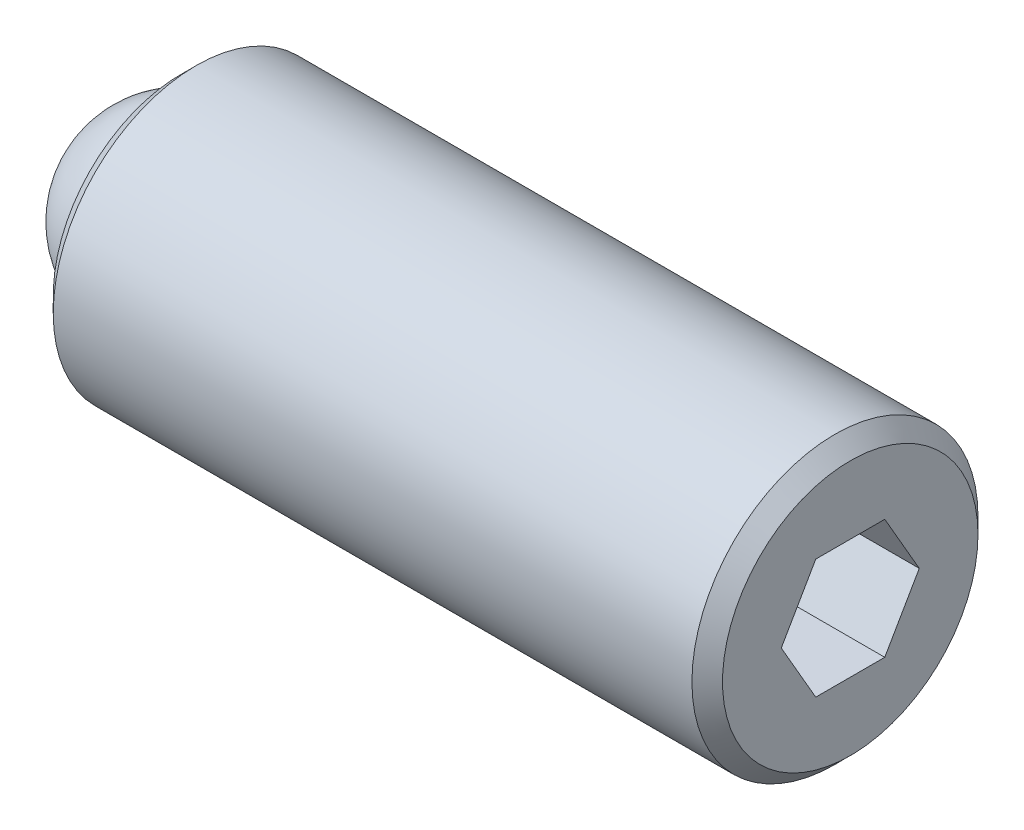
ISO-10303-21;
HEADER;
FILE_DESCRIPTION(('STEP AP214'),'2;1');
FILE_NAME('part.step','',(''),(''),'','','');
FILE_SCHEMA(('AUTOMOTIVE_DESIGN { 1 0 10303 214 1 1 1 1 }'));
ENDSEC;
DATA;
#1=APPLICATION_CONTEXT('core data for automotive mechanical design processes');
#2=APPLICATION_PROTOCOL_DEFINITION('international standard','automotive_design',2000,#1);
#3=PRODUCT_CONTEXT('',#1,'mechanical');
#4=PRODUCT('Part','Part','',(#3));
#5=PRODUCT_RELATED_PRODUCT_CATEGORY('part','',(#4));
#6=PRODUCT_DEFINITION_FORMATION('','',#4);
#7=PRODUCT_DEFINITION_CONTEXT('part definition',#1,'design');
#8=PRODUCT_DEFINITION('design','',#6,#7);
#9=PRODUCT_DEFINITION_SHAPE('','',#8);
#10=(LENGTH_UNIT() NAMED_UNIT(*) SI_UNIT(.MILLI.,.METRE.));
#11=(NAMED_UNIT(*) PLANE_ANGLE_UNIT() SI_UNIT($,.RADIAN.));
#12=(NAMED_UNIT(*) SI_UNIT($,.STERADIAN.) SOLID_ANGLE_UNIT());
#13=UNCERTAINTY_MEASURE_WITH_UNIT(LENGTH_MEASURE(1.E-05),#10,'distance_accuracy_value','');
#14=(GEOMETRIC_REPRESENTATION_CONTEXT(3) GLOBAL_UNCERTAINTY_ASSIGNED_CONTEXT((#13)) GLOBAL_UNIT_ASSIGNED_CONTEXT((#10,
#11,#12)) REPRESENTATION_CONTEXT('',''));
#15=CARTESIAN_POINT('',(0.,0.,0.));
#16=DIRECTION('',(0.,0.,1.));
#17=DIRECTION('',(1.,0.,0.));
#18=AXIS2_PLACEMENT_3D('',#15,#16,#17);
#19=CARTESIAN_POINT('',(0.,0.,0.));
#20=DIRECTION('',(0.,-1.,0.));
#21=DIRECTION('',(0.,0.,1.));
#22=AXIS2_PLACEMENT_3D('',#19,#20,#21);
#23=SPHERICAL_SURFACE('',#22,1.5875);
#24=CARTESIAN_POINT('',(0.,-1.5875,0.));
#25=VERTEX_POINT('',#24);
#26=VERTEX_LOOP('',#25);
#27=FACE_BOUND('',#26,.T.);
#28=ADVANCED_FACE('F43',(#27),#23,.T.);
#29=CLOSED_SHELL('',(#28));
#30=MANIFOLD_SOLID_BREP('B2',#29);
#31=CARTESIAN_POINT('',(11.1125,0.,0.));
#32=DIRECTION('',(-1.,0.,0.));
#33=DIRECTION('',(0.,0.,1.));
#34=AXIS2_PLACEMENT_3D('',#31,#32,#33);
#35=CYLINDRICAL_SURFACE('',#34,2.3749);
#36=CARTESIAN_POINT('',(10.8585,0.,0.));
#37=DIRECTION('',(1.,0.,0.));
#38=DIRECTION('',(0.,0.,-1.));
#39=AXIS2_PLACEMENT_3D('',#36,#37,#38);
#40=CIRCLE('',#39,2.3749);
#41=CARTESIAN_POINT('',(10.8585,0.,-2.3749));
#42=VERTEX_POINT('',#41);
#43=EDGE_CURVE('E41',#42,#42,#40,.F.);
#44=ORIENTED_EDGE('',*,*,#43,.T.);
#45=EDGE_LOOP('',(#44));
#46=FACE_BOUND('',#45,.T.);
#47=CARTESIAN_POINT('',(0.254000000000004,0.,0.));
#48=DIRECTION('',(1.,0.,0.));
#49=DIRECTION('',(0.,0.,-1.));
#50=AXIS2_PLACEMENT_3D('',#47,#48,#49);
#51=CIRCLE('',#50,2.3749);
#52=CARTESIAN_POINT('',(0.254000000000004,0.,-2.3749));
#53=VERTEX_POINT('',#52);
#54=EDGE_CURVE('E177',#53,#53,#51,.T.);
#55=ORIENTED_EDGE('',*,*,#54,.T.);
#56=EDGE_LOOP('',(#55));
#57=FACE_BOUND('',#56,.T.);
#58=ADVANCED_FACE('F56',(#46,#57),#35,.T.);
#59=CARTESIAN_POINT('',(11.1125,0.,0.));
#60=DIRECTION('',(1.,0.,0.));
#61=DIRECTION('',(0.,0.,-1.));
#62=AXIS2_PLACEMENT_3D('',#59,#60,#61);
#63=PLANE('',#62);
#64=DIRECTION('',(0.,0.866025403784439,-0.5));
#65=VECTOR('',#64,1.);
#66=CARTESIAN_POINT('',(11.1125,-0.992187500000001,-0.572839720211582));
#67=LINE('',#66,#65);
#68=CARTESIAN_POINT('',(11.1125,-0.992187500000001,-0.572839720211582));
#69=VERTEX_POINT('',#68);
#70=CARTESIAN_POINT('',(11.1125,0.,-1.14567944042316));
#71=VERTEX_POINT('',#70);
#72=EDGE_CURVE('E78',#69,#71,#67,.T.);
#73=ORIENTED_EDGE('',*,*,#72,.F.);
#74=DIRECTION('',(0.,0.,-1.));
#75=VECTOR('',#74,1.);
#76=CARTESIAN_POINT('',(11.1125,-0.992187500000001,0.572839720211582));
#77=LINE('',#76,#75);
#78=CARTESIAN_POINT('',(11.1125,-0.992187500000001,0.572839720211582));
#79=VERTEX_POINT('',#78);
#80=EDGE_CURVE('E146',#79,#69,#77,.T.);
#81=ORIENTED_EDGE('',*,*,#80,.F.);
#82=DIRECTION('',(0.,-0.866025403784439,-0.5));
#83=VECTOR('',#82,1.);
#84=CARTESIAN_POINT('',(11.1125,0.,1.14567944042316));
#85=LINE('',#84,#83);
#86=CARTESIAN_POINT('',(11.1125,0.,1.14567944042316));
#87=VERTEX_POINT('',#86);
#88=EDGE_CURVE('E170',#87,#79,#85,.T.);
#89=ORIENTED_EDGE('',*,*,#88,.F.);
#90=DIRECTION('',(0.,-0.866025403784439,0.5));
#91=VECTOR('',#90,1.);
#92=CARTESIAN_POINT('',(11.1125,0.992187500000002,0.572839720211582));
#93=LINE('',#92,#91);
#94=CARTESIAN_POINT('',(11.1125,0.992187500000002,0.572839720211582));
#95=VERTEX_POINT('',#94);
#96=EDGE_CURVE('E167',#95,#87,#93,.T.);
#97=ORIENTED_EDGE('',*,*,#96,.F.);
#98=DIRECTION('',(0.,0.,1.));
#99=VECTOR('',#98,1.);
#100=CARTESIAN_POINT('',(11.1125,0.992187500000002,-0.572839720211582));
#101=LINE('',#100,#99);
#102=CARTESIAN_POINT('',(11.1125,0.992187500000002,-0.572839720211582));
#103=VERTEX_POINT('',#102);
#104=EDGE_CURVE('E164',#103,#95,#101,.T.);
#105=ORIENTED_EDGE('',*,*,#104,.F.);
#106=DIRECTION('',(0.,0.866025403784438,0.5));
#107=VECTOR('',#106,1.);
#108=CARTESIAN_POINT('',(11.1125,0.,-1.14567944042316));
#109=LINE('',#108,#107);
#110=EDGE_CURVE('E137',#71,#103,#109,.T.);
#111=ORIENTED_EDGE('',*,*,#110,.F.);
#112=EDGE_LOOP('',(#73,#81,#89,#97,#105,#111));
#113=FACE_BOUND('',#112,.T.);
#114=CARTESIAN_POINT('',(11.1125,0.,0.));
#115=DIRECTION('',(1.,0.,0.));
#116=DIRECTION('',(0.,0.,-1.));
#117=AXIS2_PLACEMENT_3D('',#114,#115,#116);
#118=CIRCLE('',#117,2.1209);
#119=CARTESIAN_POINT('',(11.1125,0.,-2.1209));
#120=VERTEX_POINT('',#119);
#121=EDGE_CURVE('E64',#120,#120,#118,.T.);
#122=ORIENTED_EDGE('',*,*,#121,.T.);
#123=EDGE_LOOP('',(#122));
#124=FACE_BOUND('',#123,.T.);
#125=ADVANCED_FACE('F194',(#113,#124),#63,.T.);
#126=CARTESIAN_POINT('',(0.,0.,0.));
#127=DIRECTION('',(1.,0.,0.));
#128=DIRECTION('',(0.,0.,-1.));
#129=AXIS2_PLACEMENT_3D('',#126,#127,#128);
#130=PLANE('',#129);
#131=CARTESIAN_POINT('',(0.,0.,0.));
#132=DIRECTION('',(-1.,0.,0.));
#133=DIRECTION('',(0.,0.,1.));
#134=AXIS2_PLACEMENT_3D('',#131,#132,#133);
#135=CIRCLE('',#134,1.5875);
#136=CARTESIAN_POINT('',(0.,1.58623,-0.0634872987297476));
#137=VERTEX_POINT('',#136);
#138=CARTESIAN_POINT('',(0.,1.58623,0.0634872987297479));
#139=VERTEX_POINT('',#138);
#140=EDGE_CURVE('E133',#137,#139,#135,.T.);
#141=ORIENTED_EDGE('',*,*,#140,.F.);
#142=CARTESIAN_POINT('',(0.,1.5875,0.));
#143=DIRECTION('',(-1.,0.,0.));
#144=DIRECTION('',(0.,0.,1.));
#145=AXIS2_PLACEMENT_3D('',#142,#143,#144);
#146=CIRCLE('',#145,0.0635000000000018);
#147=EDGE_CURVE('E126',#139,#137,#146,.T.);
#148=ORIENTED_EDGE('',*,*,#147,.F.);
#149=EDGE_LOOP('',(#141,#148));
#150=FACE_BOUND('',#149,.T.);
#151=CARTESIAN_POINT('',(0.,0.,0.));
#152=DIRECTION('',(1.,0.,0.));
#153=DIRECTION('',(0.,0.,-1.));
#154=AXIS2_PLACEMENT_3D('',#151,#152,#153);
#155=CIRCLE('',#154,2.12089999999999);
#156=CARTESIAN_POINT('',(0.,0.,-2.12089999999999));
#157=VERTEX_POINT('',#156);
#158=EDGE_CURVE('E189',#157,#157,#155,.F.);
#159=ORIENTED_EDGE('',*,*,#158,.T.);
#160=EDGE_LOOP('',(#159));
#161=FACE_BOUND('',#160,.T.);
#162=ADVANCED_FACE('F206',(#150,#161),#130,.F.);
#163=CARTESIAN_POINT('',(0.254000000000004,0.,0.));
#164=DIRECTION('',(1.,0.,0.));
#165=DIRECTION('',(0.,0.,-1.));
#166=AXIS2_PLACEMENT_3D('',#163,#164,#165);
#167=CONICAL_SURFACE('',#166,2.3749,0.78539816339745);
#168=ORIENTED_EDGE('',*,*,#158,.F.);
#169=EDGE_LOOP('',(#168));
#170=FACE_BOUND('',#169,.T.);
#171=ORIENTED_EDGE('',*,*,#54,.F.);
#172=EDGE_LOOP('',(#171));
#173=FACE_BOUND('',#172,.T.);
#174=ADVANCED_FACE('F198',(#170,#173),#167,.T.);
#175=CARTESIAN_POINT('',(11.1125,0.,0.));
#176=DIRECTION('',(-1.,0.,0.));
#177=DIRECTION('',(0.,0.,1.));
#178=AXIS2_PLACEMENT_3D('',#175,#176,#177);
#179=CONICAL_SURFACE('',#178,2.1209,0.785398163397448);
#180=ORIENTED_EDGE('',*,*,#43,.F.);
#181=EDGE_LOOP('',(#180));
#182=FACE_BOUND('',#181,.T.);
#183=ORIENTED_EDGE('',*,*,#121,.F.);
#184=EDGE_LOOP('',(#183));
#185=FACE_BOUND('',#184,.T.);
#186=ADVANCED_FACE('F58',(#182,#185),#179,.T.);
#187=CARTESIAN_POINT('',(8.8265,-0.992187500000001,-0.572839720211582));
#188=DIRECTION('',(0.,-0.5,-0.866025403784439));
#189=DIRECTION('',(0.,0.866025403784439,-0.5));
#190=AXIS2_PLACEMENT_3D('',#187,#188,#189);
#191=PLANE('',#190);
#192=ORIENTED_EDGE('',*,*,#72,.T.);
#193=DIRECTION('',(1.,0.,0.));
#194=VECTOR('',#193,1.);
#195=CARTESIAN_POINT('',(8.8265,0.,-1.14567944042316));
#196=LINE('',#195,#194);
#197=CARTESIAN_POINT('',(8.8265,0.,-1.14567944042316));
#198=VERTEX_POINT('',#197);
#199=EDGE_CURVE('E160',#198,#71,#196,.T.);
#200=ORIENTED_EDGE('',*,*,#199,.F.);
#201=DIRECTION('',(0.,0.866025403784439,-0.5));
#202=VECTOR('',#201,1.);
#203=CARTESIAN_POINT('',(8.8265,-0.992187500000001,-0.572839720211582));
#204=LINE('',#203,#202);
#205=CARTESIAN_POINT('',(8.8265,-0.992187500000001,-0.572839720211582));
#206=VERTEX_POINT('',#205);
#207=EDGE_CURVE('E142',#206,#198,#204,.T.);
#208=ORIENTED_EDGE('',*,*,#207,.F.);
#209=DIRECTION('',(1.,0.,0.));
#210=VECTOR('',#209,1.);
#211=CARTESIAN_POINT('',(8.8265,-0.992187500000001,-0.572839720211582));
#212=LINE('',#211,#210);
#213=EDGE_CURVE('E175',#206,#69,#212,.T.);
#214=ORIENTED_EDGE('',*,*,#213,.T.);
#215=EDGE_LOOP('',(#192,#200,#208,#214));
#216=FACE_BOUND('',#215,.T.);
#217=ADVANCED_FACE('F197',(#216),#191,.F.);
#218=CARTESIAN_POINT('',(8.8265,-0.992187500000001,0.572839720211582));
#219=DIRECTION('',(0.,-1.,0.));
#220=DIRECTION('',(0.,0.,-1.));
#221=AXIS2_PLACEMENT_3D('',#218,#219,#220);
#222=PLANE('',#221);
#223=ORIENTED_EDGE('',*,*,#80,.T.);
#224=ORIENTED_EDGE('',*,*,#213,.F.);
#225=DIRECTION('',(0.,0.,-1.));
#226=VECTOR('',#225,1.);
#227=CARTESIAN_POINT('',(8.8265,-0.992187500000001,0.572839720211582));
#228=LINE('',#227,#226);
#229=CARTESIAN_POINT('',(8.8265,-0.992187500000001,0.572839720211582));
#230=VERTEX_POINT('',#229);
#231=EDGE_CURVE('E158',#230,#206,#228,.T.);
#232=ORIENTED_EDGE('',*,*,#231,.F.);
#233=DIRECTION('',(1.,0.,0.));
#234=VECTOR('',#233,1.);
#235=CARTESIAN_POINT('',(8.8265,-0.992187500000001,0.572839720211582));
#236=LINE('',#235,#234);
#237=EDGE_CURVE('E178',#230,#79,#236,.T.);
#238=ORIENTED_EDGE('',*,*,#237,.T.);
#239=EDGE_LOOP('',(#223,#224,#232,#238));
#240=FACE_BOUND('',#239,.T.);
#241=ADVANCED_FACE('F204',(#240),#222,.F.);
#242=CARTESIAN_POINT('',(8.8265,0.,1.14567944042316));
#243=DIRECTION('',(0.,-0.5,0.866025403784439));
#244=DIRECTION('',(0.,-0.866025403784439,-0.5));
#245=AXIS2_PLACEMENT_3D('',#242,#243,#244);
#246=PLANE('',#245);
#247=ORIENTED_EDGE('',*,*,#88,.T.);
#248=ORIENTED_EDGE('',*,*,#237,.F.);
#249=DIRECTION('',(0.,-0.866025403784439,-0.5));
#250=VECTOR('',#249,1.);
#251=CARTESIAN_POINT('',(8.8265,0.,1.14567944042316));
#252=LINE('',#251,#250);
#253=CARTESIAN_POINT('',(8.8265,0.,1.14567944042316));
#254=VERTEX_POINT('',#253);
#255=EDGE_CURVE('E155',#254,#230,#252,.T.);
#256=ORIENTED_EDGE('',*,*,#255,.F.);
#257=DIRECTION('',(1.,0.,0.));
#258=VECTOR('',#257,1.);
#259=CARTESIAN_POINT('',(8.8265,0.,1.14567944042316));
#260=LINE('',#259,#258);
#261=EDGE_CURVE('E180',#254,#87,#260,.T.);
#262=ORIENTED_EDGE('',*,*,#261,.T.);
#263=EDGE_LOOP('',(#247,#248,#256,#262));
#264=FACE_BOUND('',#263,.T.);
#265=ADVANCED_FACE('F234',(#264),#246,.F.);
#266=CARTESIAN_POINT('',(8.8265,0.992187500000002,0.572839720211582));
#267=DIRECTION('',(0.,0.5,0.866025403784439));
#268=DIRECTION('',(0.,-0.866025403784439,0.5));
#269=AXIS2_PLACEMENT_3D('',#266,#267,#268);
#270=PLANE('',#269);
#271=ORIENTED_EDGE('',*,*,#96,.T.);
#272=ORIENTED_EDGE('',*,*,#261,.F.);
#273=DIRECTION('',(0.,-0.866025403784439,0.5));
#274=VECTOR('',#273,1.);
#275=CARTESIAN_POINT('',(8.8265,0.992187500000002,0.572839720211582));
#276=LINE('',#275,#274);
#277=CARTESIAN_POINT('',(8.8265,0.992187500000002,0.572839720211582));
#278=VERTEX_POINT('',#277);
#279=EDGE_CURVE('E152',#278,#254,#276,.T.);
#280=ORIENTED_EDGE('',*,*,#279,.F.);
#281=DIRECTION('',(1.,0.,0.));
#282=VECTOR('',#281,1.);
#283=CARTESIAN_POINT('',(8.8265,0.992187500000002,0.572839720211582));
#284=LINE('',#283,#282);
#285=EDGE_CURVE('E182',#278,#95,#284,.T.);
#286=ORIENTED_EDGE('',*,*,#285,.T.);
#287=EDGE_LOOP('',(#271,#272,#280,#286));
#288=FACE_BOUND('',#287,.T.);
#289=ADVANCED_FACE('F230',(#288),#270,.F.);
#290=CARTESIAN_POINT('',(8.8265,0.992187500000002,-0.572839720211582));
#291=DIRECTION('',(0.,1.,0.));
#292=DIRECTION('',(0.,0.,1.));
#293=AXIS2_PLACEMENT_3D('',#290,#291,#292);
#294=PLANE('',#293);
#295=ORIENTED_EDGE('',*,*,#104,.T.);
#296=ORIENTED_EDGE('',*,*,#285,.F.);
#297=DIRECTION('',(0.,0.,1.));
#298=VECTOR('',#297,1.);
#299=CARTESIAN_POINT('',(8.8265,0.992187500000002,-0.572839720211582));
#300=LINE('',#299,#298);
#301=CARTESIAN_POINT('',(8.8265,0.992187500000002,-0.572839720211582));
#302=VERTEX_POINT('',#301);
#303=EDGE_CURVE('E149',#302,#278,#300,.T.);
#304=ORIENTED_EDGE('',*,*,#303,.F.);
#305=DIRECTION('',(1.,0.,0.));
#306=VECTOR('',#305,1.);
#307=CARTESIAN_POINT('',(8.8265,0.992187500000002,-0.572839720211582));
#308=LINE('',#307,#306);
#309=EDGE_CURVE('E184',#302,#103,#308,.T.);
#310=ORIENTED_EDGE('',*,*,#309,.T.);
#311=EDGE_LOOP('',(#295,#296,#304,#310));
#312=FACE_BOUND('',#311,.T.);
#313=ADVANCED_FACE('F226',(#312),#294,.F.);
#314=CARTESIAN_POINT('',(8.8265,0.,-1.14567944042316));
#315=DIRECTION('',(0.,0.5,-0.866025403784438));
#316=DIRECTION('',(0.,0.866025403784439,0.5));
#317=AXIS2_PLACEMENT_3D('',#314,#315,#316);
#318=PLANE('',#317);
#319=ORIENTED_EDGE('',*,*,#110,.T.);
#320=ORIENTED_EDGE('',*,*,#309,.F.);
#321=DIRECTION('',(0.,0.866025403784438,0.5));
#322=VECTOR('',#321,1.);
#323=CARTESIAN_POINT('',(8.8265,0.,-1.14567944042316));
#324=LINE('',#323,#322);
#325=EDGE_CURVE('E145',#198,#302,#324,.T.);
#326=ORIENTED_EDGE('',*,*,#325,.F.);
#327=ORIENTED_EDGE('',*,*,#199,.T.);
#328=EDGE_LOOP('',(#319,#320,#326,#327));
#329=FACE_BOUND('',#328,.T.);
#330=ADVANCED_FACE('F222',(#329),#318,.F.);
#331=CARTESIAN_POINT('',(8.8265,0.,0.));
#332=DIRECTION('',(1.,0.,0.));
#333=DIRECTION('',(0.,0.,-1.));
#334=AXIS2_PLACEMENT_3D('',#331,#332,#333);
#335=PLANE('',#334);
#336=ORIENTED_EDGE('',*,*,#207,.T.);
#337=ORIENTED_EDGE('',*,*,#325,.T.);
#338=ORIENTED_EDGE('',*,*,#303,.T.);
#339=ORIENTED_EDGE('',*,*,#279,.T.);
#340=ORIENTED_EDGE('',*,*,#255,.T.);
#341=ORIENTED_EDGE('',*,*,#231,.T.);
#342=EDGE_LOOP('',(#336,#337,#338,#339,#340,#341));
#343=FACE_BOUND('',#342,.T.);
#344=ADVANCED_FACE('F225',(#343),#335,.T.);
#345=CARTESIAN_POINT('',(1.5875,0.,0.));
#346=DIRECTION('',(-1.,0.,0.));
#347=DIRECTION('',(0.,0.,1.));
#348=AXIS2_PLACEMENT_3D('',#345,#346,#347);
#349=CYLINDRICAL_SURFACE('',#348,1.5875);
#350=CARTESIAN_POINT('',(1.5875,0.,0.));
#351=DIRECTION('',(-1.,0.,0.));
#352=DIRECTION('',(0.,0.,1.));
#353=AXIS2_PLACEMENT_3D('',#350,#351,#352);
#354=CIRCLE('',#353,1.5875);
#355=CARTESIAN_POINT('',(1.5875,1.58623,-0.0634872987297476));
#356=VERTEX_POINT('',#355);
#357=CARTESIAN_POINT('',(1.5875,1.58623,0.0634872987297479));
#358=VERTEX_POINT('',#357);
#359=EDGE_CURVE('E131',#356,#358,#354,.T.);
#360=ORIENTED_EDGE('',*,*,#359,.F.);
#361=DIRECTION('',(-1.,0.,0.));
#362=VECTOR('',#361,1.);
#363=CARTESIAN_POINT('',(1.5875,1.58623,-0.0634872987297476));
#364=LINE('',#363,#362);
#365=EDGE_CURVE('E124',#356,#137,#364,.T.);
#366=ORIENTED_EDGE('',*,*,#365,.T.);
#367=ORIENTED_EDGE('',*,*,#140,.T.);
#368=DIRECTION('',(-1.,0.,0.));
#369=VECTOR('',#368,1.);
#370=CARTESIAN_POINT('',(1.5875,1.58623,0.0634872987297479));
#371=LINE('',#370,#369);
#372=EDGE_CURVE('E121',#358,#139,#371,.T.);
#373=ORIENTED_EDGE('',*,*,#372,.F.);
#374=EDGE_LOOP('',(#360,#366,#367,#373));
#375=FACE_BOUND('',#374,.T.);
#376=ADVANCED_FACE('F130',(#375),#349,.F.);
#377=CARTESIAN_POINT('',(1.5875,0.,0.));
#378=DIRECTION('',(-1.,0.,0.));
#379=DIRECTION('',(0.,0.,1.));
#380=AXIS2_PLACEMENT_3D('',#377,#378,#379);
#381=PLANE('',#380);
#382=ORIENTED_EDGE('',*,*,#359,.T.);
#383=CARTESIAN_POINT('',(1.5875,1.5875,0.));
#384=DIRECTION('',(-1.,0.,0.));
#385=DIRECTION('',(0.,0.,1.));
#386=AXIS2_PLACEMENT_3D('',#383,#384,#385);
#387=CIRCLE('',#386,0.0635000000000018);
#388=EDGE_CURVE('E70',#358,#356,#387,.T.);
#389=ORIENTED_EDGE('',*,*,#388,.T.);
#390=EDGE_LOOP('',(#382,#389));
#391=FACE_BOUND('',#390,.T.);
#392=ADVANCED_FACE('F135',(#391),#381,.T.);
#393=CARTESIAN_POINT('',(1.5875,1.5875,0.));
#394=DIRECTION('',(-1.,0.,0.));
#395=DIRECTION('',(0.,0.,1.));
#396=AXIS2_PLACEMENT_3D('',#393,#394,#395);
#397=CYLINDRICAL_SURFACE('',#396,0.0635000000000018);
#398=ORIENTED_EDGE('',*,*,#147,.T.);
#399=ORIENTED_EDGE('',*,*,#365,.F.);
#400=ORIENTED_EDGE('',*,*,#388,.F.);
#401=ORIENTED_EDGE('',*,*,#372,.T.);
#402=EDGE_LOOP('',(#398,#399,#400,#401));
#403=FACE_BOUND('',#402,.T.);
#404=ADVANCED_FACE('F120',(#403),#397,.F.);
#405=CLOSED_SHELL('',(#58,#125,#162,#174,#186,#217,#241,#265,#289,#313,#330,#344,#376,#392,#404));
#406=MANIFOLD_SOLID_BREP('B6',#405);
#407=ADVANCED_BREP_SHAPE_REPRESENTATION('',(#18,#30,#406),#14);
#408=SHAPE_DEFINITION_REPRESENTATION(#9,#407);
ENDSEC;
END-ISO-10303-21;
